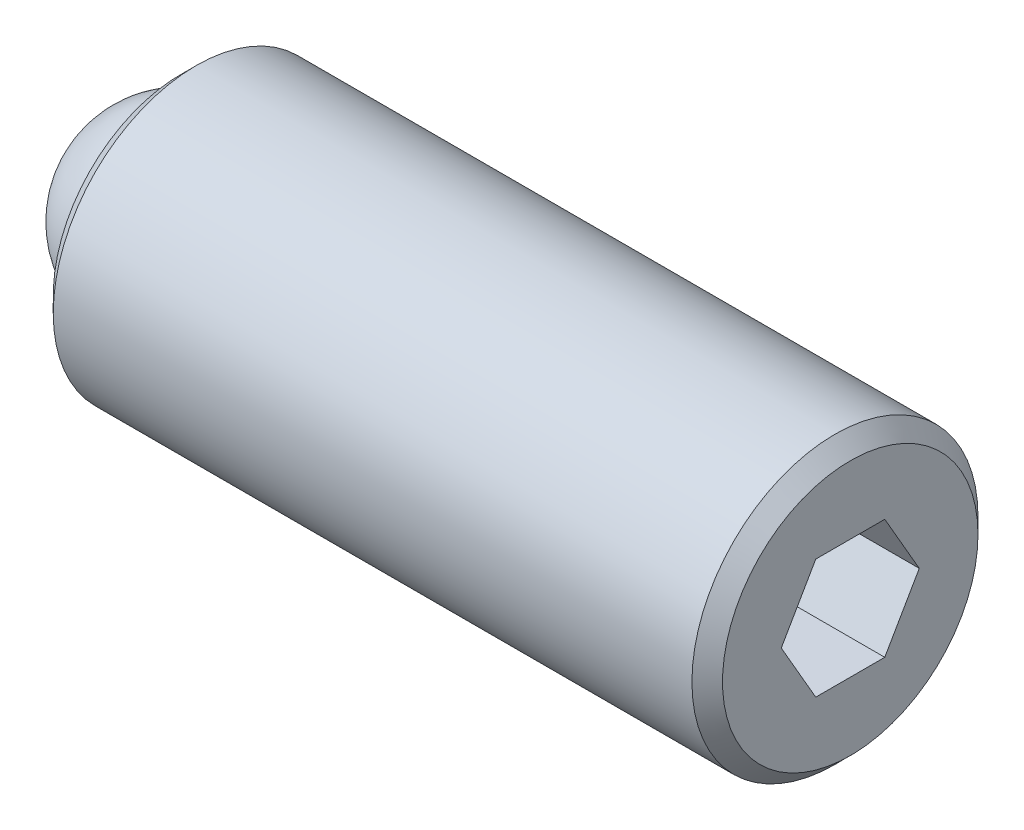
from build123d import *

# Parameters (mm, degrees)
SKETCH2_R           = 2.3749
BOSS_EXTRUDE1_DEPTH = 11.1125
CHAMFER1_SIZE       = 0.254
CHAMFER2_SIZE       = 0.254
CUT_EXTRUDE2_DEPTH  = 2.286
SKETCH3_R           = 1.5875
CUT_EXTRUDE3_DEPTH  = 1.5875
CUT_EXTRUDE6_DEPTH  = 1.5875


with BuildPart() as part:
    # Sketch2 → Boss-Extrude1 (new body)
    with BuildSketch(Plane(origin=(0, 0, 0), x_dir=(0, 0, -1), z_dir=(1, 0, 0))):
        Circle(SKETCH2_R)
    extrude(amount=BOSS_EXTRUDE1_DEPTH)

    # Chamfer1
    chamfer1_edges = [part.edges().sort_by_distance(p)[0] for p in [
        (0, 0, 2.3749),
    ]]
    chamfer(chamfer1_edges, length=CHAMFER1_SIZE)

    # Chamfer2
    chamfer2_edges = [part.edges().sort_by_distance(p)[0] for p in [
        (11.1125, 0, 2.3749),
    ]]
    chamfer(chamfer2_edges, length=CHAMFER2_SIZE)

    # Sketch4 → Cut-Extrude2 (cut)
    with BuildSketch(Plane(origin=(11.1125, 0, 0), x_dir=(0, 0, -1), z_dir=(1, 0, 0))):
        Polygon((1.14567944, 0), (0.57283972, 0.9921875), (-0.57283972, 0.9921875), (-1.14567944, 0), (-0.57283972, -0.9921875), (0.57283972, -0.9921875), align=None)
    extrude(amount=-CUT_EXTRUDE2_DEPTH, mode=Mode.SUBTRACT)

    # Sketch3 → Cut-Extrude3 (cut)
    with BuildSketch(Plane.ZY):
        Circle(SKETCH3_R)
    extrude(amount=-CUT_EXTRUDE3_DEPTH, mode=Mode.SUBTRACT)

    # Sketch6 → Cut-Extrude6 (cut)
    with BuildSketch(Plane.ZY):
        with BuildLine():
            ThreePointArc((0.063487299, 1.58623), (0, 1.5875), (-0.063487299, 1.58623))
            ThreePointArc((-0.063487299, 1.58623), (0, 1.651), (0.063487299, 1.58623))
        make_face()
    extrude(amount=-CUT_EXTRUDE6_DEPTH, mode=Mode.SUBTRACT)


with BuildPart() as body_2:
    # Sketch5 → Revolve1 (revolve)
    with BuildSketch(Plane.ZY):
        with BuildLine():
            Line((0, 0), (0, -1.5875))
            ThreePointArc((0, -1.5875), (-1.5875, 0), (0, 1.5875))
            Line((0, 1.5875), (0, 0))
        make_face()
    revolve(axis=Axis((0, 0, 0), (0, 1, 0)))


solid = Compound([part.part, body_2.part])
